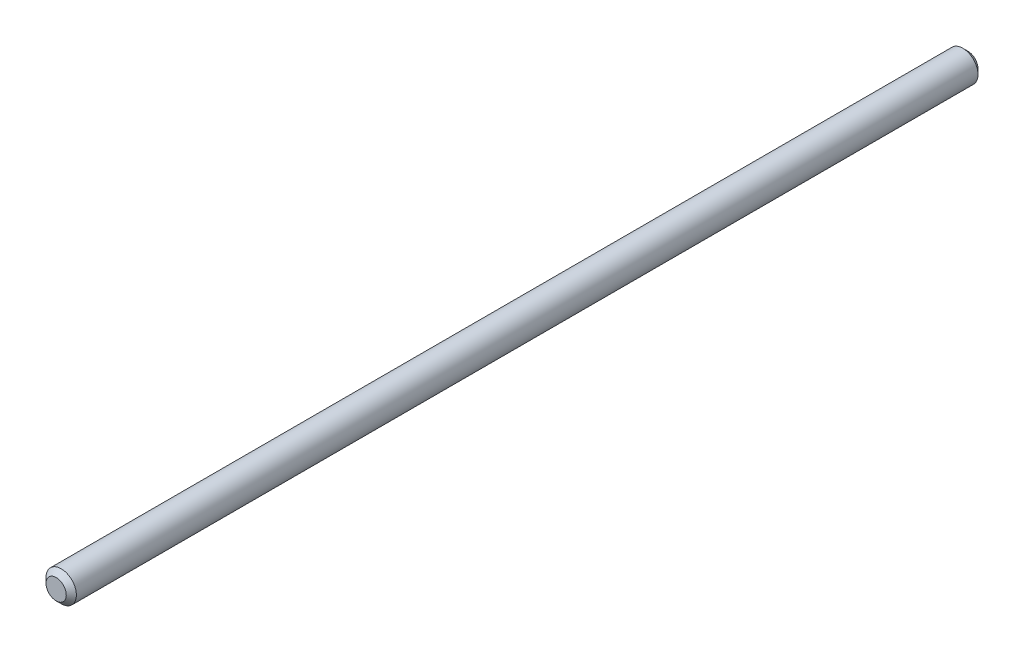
from build123d import *

# Parameters (mm, degrees)
ESQUISSE1_R          = 1.5
BASE_EXTRUSION_DEPTH = 90
CHANFREIN1_SIZE      = 0.5


with BuildPart() as part:
    # Esquisse1 → Base-Extrusion (new body)
    with BuildSketch(Plane.XY):
        with Locations(Location((0, 0, 0), (0, 0, 180))):
            Circle(ESQUISSE1_R)
    extrude(amount=BASE_EXTRUSION_DEPTH)

    # Chanfrein1
    chanfrein1_edges = [part.edges().sort_by_distance(p)[0] for p in [
        (1.5, 0, 0),
        (1.5, 0, 90),
    ]]
    chamfer(chanfrein1_edges, length=CHANFREIN1_SIZE)


solid = part.part
